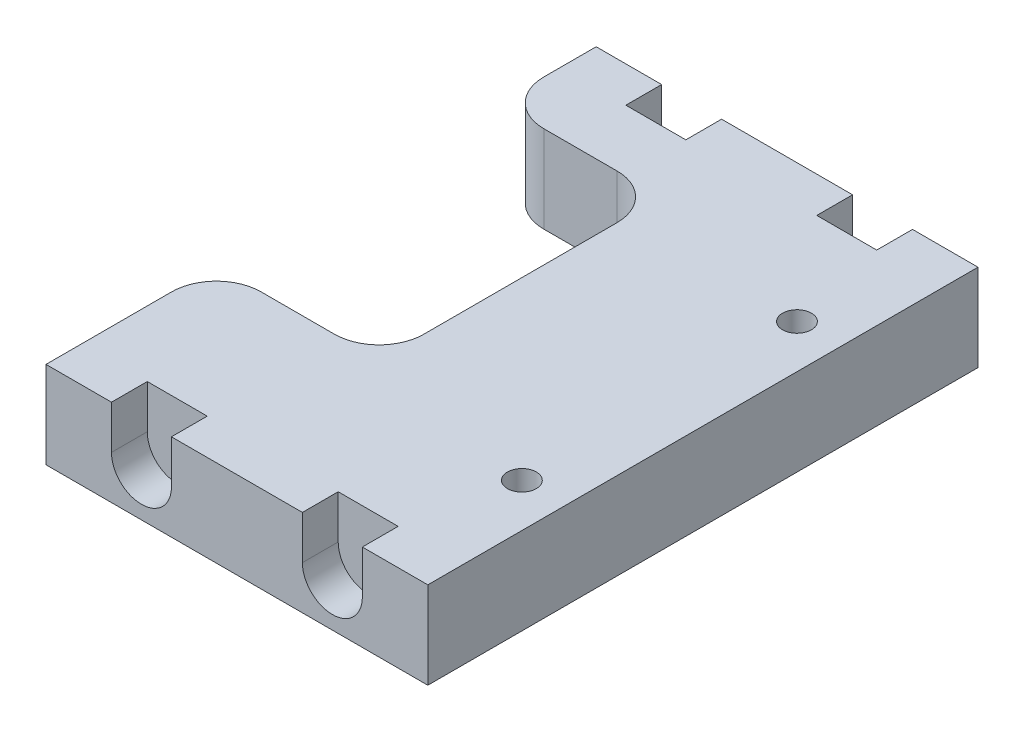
ISO-10303-21;
HEADER;
FILE_DESCRIPTION(('STEP AP214'),'2;1');
FILE_NAME('part.step','',(''),(''),'','','');
FILE_SCHEMA(('AUTOMOTIVE_DESIGN { 1 0 10303 214 1 1 1 1 }'));
ENDSEC;
DATA;
#1=APPLICATION_CONTEXT('core data for automotive mechanical design processes');
#2=APPLICATION_PROTOCOL_DEFINITION('international standard','automotive_design',2000,#1);
#3=PRODUCT_CONTEXT('',#1,'mechanical');
#4=PRODUCT('Part','Part','',(#3));
#5=PRODUCT_RELATED_PRODUCT_CATEGORY('part','',(#4));
#6=PRODUCT_DEFINITION_FORMATION('','',#4);
#7=PRODUCT_DEFINITION_CONTEXT('part definition',#1,'design');
#8=PRODUCT_DEFINITION('design','',#6,#7);
#9=PRODUCT_DEFINITION_SHAPE('','',#8);
#10=(LENGTH_UNIT() NAMED_UNIT(*) SI_UNIT(.MILLI.,.METRE.));
#11=(NAMED_UNIT(*) PLANE_ANGLE_UNIT() SI_UNIT($,.RADIAN.));
#12=(NAMED_UNIT(*) SI_UNIT($,.STERADIAN.) SOLID_ANGLE_UNIT());
#13=UNCERTAINTY_MEASURE_WITH_UNIT(LENGTH_MEASURE(1.E-05),#10,'distance_accuracy_value','');
#14=(GEOMETRIC_REPRESENTATION_CONTEXT(3) GLOBAL_UNCERTAINTY_ASSIGNED_CONTEXT((#13)) GLOBAL_UNIT_ASSIGNED_CONTEXT((#10,
#11,#12)) REPRESENTATION_CONTEXT('',''));
#15=CARTESIAN_POINT('',(0.,0.,0.));
#16=DIRECTION('',(0.,0.,1.));
#17=DIRECTION('',(1.,0.,0.));
#18=AXIS2_PLACEMENT_3D('',#15,#16,#17);
#19=CARTESIAN_POINT('',(-654.083526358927,561.091856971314,0.));
#20=DIRECTION('',(0.,1.,0.));
#21=DIRECTION('',(0.,0.,1.));
#22=AXIS2_PLACEMENT_3D('',#19,#20,#21);
#23=PLANE('',#22);
#24=CARTESIAN_POINT('',(-726.12842981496,561.091856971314,-19.5199000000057));
#25=DIRECTION('',(0.,1.,0.));
#26=DIRECTION('',(0.,0.,1.));
#27=AXIS2_PLACEMENT_3D('',#24,#25,#26);
#28=CIRCLE('',#27,2.05000000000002);
#29=CARTESIAN_POINT('',(-726.12842981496,561.091856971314,-17.4699000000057));
#30=VERTEX_POINT('',#29);
#31=EDGE_CURVE('E335',#30,#30,#28,.T.);
#32=ORIENTED_EDGE('',*,*,#31,.F.);
#33=EDGE_LOOP('',(#32));
#34=FACE_BOUND('',#33,.T.);
#35=CARTESIAN_POINT('',(-726.128429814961,561.091856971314,-58.5597000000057));
#36=DIRECTION('',(0.,1.,0.));
#37=DIRECTION('',(0.,0.,1.));
#38=AXIS2_PLACEMENT_3D('',#35,#36,#37);
#39=CIRCLE('',#38,2.05000000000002);
#40=CARTESIAN_POINT('',(-726.128429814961,561.091856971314,-56.5097000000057));
#41=VERTEX_POINT('',#40);
#42=EDGE_CURVE('E307',#41,#41,#39,.T.);
#43=ORIENTED_EDGE('',*,*,#42,.F.);
#44=EDGE_LOOP('',(#43));
#45=FACE_BOUND('',#44,.T.);
#46=DIRECTION('',(-1.,0.,0.));
#47=VECTOR('',#46,1.);
#48=CARTESIAN_POINT('',(-654.083526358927,561.091856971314,0.));
#49=LINE('',#48,#47);
#50=CARTESIAN_POINT('',(-764.852299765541,561.091856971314,0.));
#51=VERTEX_POINT('',#50);
#52=CARTESIAN_POINT('',(-774.144989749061,561.091856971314,0.));
#53=VERTEX_POINT('',#52);
#54=EDGE_CURVE('E435',#51,#53,#49,.T.);
#55=ORIENTED_EDGE('',*,*,#54,.F.);
#56=DIRECTION('',(0.,0.,1.));
#57=VECTOR('',#56,1.);
#58=CARTESIAN_POINT('',(-764.852299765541,561.091856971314,-5.08));
#59=LINE('',#58,#57);
#60=CARTESIAN_POINT('',(-764.852299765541,561.091856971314,-5.08));
#61=VERTEX_POINT('',#60);
#62=EDGE_CURVE('E318',#61,#51,#59,.T.);
#63=ORIENTED_EDGE('',*,*,#62,.F.);
#64=DIRECTION('',(-1.,0.,0.));
#65=VECTOR('',#64,1.);
#66=CARTESIAN_POINT('',(0.,561.091856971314,-5.08));
#67=LINE('',#66,#65);
#68=CARTESIAN_POINT('',(-756.343299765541,561.091856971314,-5.08));
#69=VERTEX_POINT('',#68);
#70=EDGE_CURVE('E292',#69,#61,#67,.T.);
#71=ORIENTED_EDGE('',*,*,#70,.F.);
#72=DIRECTION('',(0.,0.,1.));
#73=VECTOR('',#72,1.);
#74=CARTESIAN_POINT('',(-756.343299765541,561.091856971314,-5.08));
#75=LINE('',#74,#73);
#76=CARTESIAN_POINT('',(-756.343299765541,561.091856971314,0.));
#77=VERTEX_POINT('',#76);
#78=EDGE_CURVE('E287',#69,#77,#75,.T.);
#79=ORIENTED_EDGE('',*,*,#78,.T.);
#80=CARTESIAN_POINT('',(-737.757919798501,561.091856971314,0.));
#81=VERTEX_POINT('',#80);
#82=EDGE_CURVE('E444',#81,#77,#49,.T.);
#83=ORIENTED_EDGE('',*,*,#82,.F.);
#84=DIRECTION('',(0.,0.,1.));
#85=VECTOR('',#84,1.);
#86=CARTESIAN_POINT('',(-737.757919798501,561.091856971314,-5.08));
#87=LINE('',#86,#85);
#88=CARTESIAN_POINT('',(-737.757919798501,561.091856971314,-5.08));
#89=VERTEX_POINT('',#88);
#90=EDGE_CURVE('E341',#89,#81,#87,.T.);
#91=ORIENTED_EDGE('',*,*,#90,.F.);
#92=DIRECTION('',(-1.,0.,0.));
#93=VECTOR('',#92,1.);
#94=CARTESIAN_POINT('',(0.,561.091856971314,-5.08));
#95=LINE('',#94,#93);
#96=CARTESIAN_POINT('',(-729.248919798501,561.091856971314,-5.08));
#97=VERTEX_POINT('',#96);
#98=EDGE_CURVE('E327',#97,#89,#95,.T.);
#99=ORIENTED_EDGE('',*,*,#98,.F.);
#100=DIRECTION('',(0.,0.,1.));
#101=VECTOR('',#100,1.);
#102=CARTESIAN_POINT('',(-729.248919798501,561.091856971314,-5.08));
#103=LINE('',#102,#101);
#104=CARTESIAN_POINT('',(-729.248919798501,561.091856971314,0.));
#105=VERTEX_POINT('',#104);
#106=EDGE_CURVE('E343',#97,#105,#103,.T.);
#107=ORIENTED_EDGE('',*,*,#106,.T.);
#108=CARTESIAN_POINT('',(-719.95622981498,561.091856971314,2.22044604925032E-13));
#109=VERTEX_POINT('',#108);
#110=EDGE_CURVE('E440',#109,#105,#49,.T.);
#111=ORIENTED_EDGE('',*,*,#110,.F.);
#112=DIRECTION('',(0.,0.,-1.));
#113=VECTOR('',#112,1.);
#114=CARTESIAN_POINT('',(-719.95622981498,561.091856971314,2.22044604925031E-13));
#115=LINE('',#114,#113);
#116=CARTESIAN_POINT('',(-719.95622981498,561.091856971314,-78.0796));
#117=VERTEX_POINT('',#116);
#118=EDGE_CURVE('E371',#109,#117,#115,.T.);
#119=ORIENTED_EDGE('',*,*,#118,.T.);
#120=DIRECTION('',(1.,0.,0.));
#121=VECTOR('',#120,1.);
#122=CARTESIAN_POINT('',(-654.083526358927,561.091856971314,-78.0796));
#123=LINE('',#122,#121);
#124=CARTESIAN_POINT('',(-729.248919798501,561.091856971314,-78.0796));
#125=VERTEX_POINT('',#124);
#126=EDGE_CURVE('E443',#125,#117,#123,.T.);
#127=ORIENTED_EDGE('',*,*,#126,.F.);
#128=DIRECTION('',(0.,0.,-1.));
#129=VECTOR('',#128,1.);
#130=CARTESIAN_POINT('',(-729.248919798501,561.091856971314,-72.9996));
#131=LINE('',#130,#129);
#132=CARTESIAN_POINT('',(-729.248919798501,561.091856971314,-72.9996));
#133=VERTEX_POINT('',#132);
#134=EDGE_CURVE('E372',#133,#125,#131,.T.);
#135=ORIENTED_EDGE('',*,*,#134,.F.);
#136=DIRECTION('',(1.,0.,0.));
#137=VECTOR('',#136,1.);
#138=CARTESIAN_POINT('',(0.,561.091856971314,-72.9996));
#139=LINE('',#138,#137);
#140=CARTESIAN_POINT('',(-737.757919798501,561.091856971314,-72.9996));
#141=VERTEX_POINT('',#140);
#142=EDGE_CURVE('E353',#141,#133,#139,.T.);
#143=ORIENTED_EDGE('',*,*,#142,.F.);
#144=DIRECTION('',(0.,0.,-1.));
#145=VECTOR('',#144,1.);
#146=CARTESIAN_POINT('',(-737.757919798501,561.091856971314,-72.9996));
#147=LINE('',#146,#145);
#148=CARTESIAN_POINT('',(-737.757919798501,561.091856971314,-78.0796));
#149=VERTEX_POINT('',#148);
#150=EDGE_CURVE('E374',#141,#149,#147,.T.);
#151=ORIENTED_EDGE('',*,*,#150,.T.);
#152=CARTESIAN_POINT('',(-756.343299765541,561.091856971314,-78.0796));
#153=VERTEX_POINT('',#152);
#154=EDGE_CURVE('E449',#153,#149,#123,.T.);
#155=ORIENTED_EDGE('',*,*,#154,.F.);
#156=DIRECTION('',(0.,0.,-1.));
#157=VECTOR('',#156,1.);
#158=CARTESIAN_POINT('',(-756.343299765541,561.091856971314,-72.9996));
#159=LINE('',#158,#157);
#160=CARTESIAN_POINT('',(-756.343299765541,561.091856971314,-72.9996));
#161=VERTEX_POINT('',#160);
#162=EDGE_CURVE('E400',#161,#153,#159,.T.);
#163=ORIENTED_EDGE('',*,*,#162,.F.);
#164=DIRECTION('',(1.,0.,0.));
#165=VECTOR('',#164,1.);
#166=CARTESIAN_POINT('',(0.,561.091856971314,-72.9996));
#167=LINE('',#166,#165);
#168=CARTESIAN_POINT('',(-764.852299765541,561.091856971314,-72.9996));
#169=VERTEX_POINT('',#168);
#170=EDGE_CURVE('E385',#169,#161,#167,.T.);
#171=ORIENTED_EDGE('',*,*,#170,.F.);
#172=DIRECTION('',(0.,0.,-1.));
#173=VECTOR('',#172,1.);
#174=CARTESIAN_POINT('',(-764.852299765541,561.091856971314,-72.9996));
#175=LINE('',#174,#173);
#176=CARTESIAN_POINT('',(-764.852299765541,561.091856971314,-78.0796));
#177=VERTEX_POINT('',#176);
#178=EDGE_CURVE('E402',#169,#177,#175,.T.);
#179=ORIENTED_EDGE('',*,*,#178,.T.);
#180=CARTESIAN_POINT('',(-774.144989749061,561.091856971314,-78.0796));
#181=VERTEX_POINT('',#180);
#182=EDGE_CURVE('E445',#181,#177,#123,.T.);
#183=ORIENTED_EDGE('',*,*,#182,.F.);
#184=DIRECTION('',(0.,0.,1.));
#185=VECTOR('',#184,1.);
#186=CARTESIAN_POINT('',(-774.144989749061,561.091856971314,0.));
#187=LINE('',#186,#185);
#188=CARTESIAN_POINT('',(-774.144989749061,561.091856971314,-70.6412013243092));
#189=VERTEX_POINT('',#188);
#190=EDGE_CURVE('E450',#181,#189,#187,.T.);
#191=ORIENTED_EDGE('',*,*,#190,.T.);
#192=CARTESIAN_POINT('',(-767.794989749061,561.091856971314,-70.6412013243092));
#193=DIRECTION('',(0.,1.,0.));
#194=DIRECTION('',(0.,0.,1.));
#195=AXIS2_PLACEMENT_3D('',#192,#193,#194);
#196=CIRCLE('',#195,6.35);
#197=CARTESIAN_POINT('',(-767.794989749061,561.091856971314,-64.2912013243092));
#198=VERTEX_POINT('',#197);
#199=EDGE_CURVE('E480',#189,#198,#196,.T.);
#200=ORIENTED_EDGE('',*,*,#199,.T.);
#201=DIRECTION('',(1.,0.,0.));
#202=VECTOR('',#201,1.);
#203=CARTESIAN_POINT('',(0.,561.091856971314,-64.2912013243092));
#204=LINE('',#203,#202);
#205=CARTESIAN_POINT('',(-757.392582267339,561.091856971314,-64.2912013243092));
#206=VERTEX_POINT('',#205);
#207=EDGE_CURVE('E416',#198,#206,#204,.T.);
#208=ORIENTED_EDGE('',*,*,#207,.T.);
#209=CARTESIAN_POINT('',(-757.392582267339,561.091856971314,-57.9412013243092));
#210=DIRECTION('',(0.,1.,0.));
#211=DIRECTION('',(0.,0.,1.));
#212=AXIS2_PLACEMENT_3D('',#209,#210,#211);
#213=CIRCLE('',#212,6.35);
#214=CARTESIAN_POINT('',(-751.042582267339,561.091856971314,-57.9412013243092));
#215=VERTEX_POINT('',#214);
#216=EDGE_CURVE('E497',#206,#215,#213,.F.);
#217=ORIENTED_EDGE('',*,*,#216,.T.);
#218=DIRECTION('',(0.,0.,1.));
#219=VECTOR('',#218,1.);
#220=CARTESIAN_POINT('',(-751.042582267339,561.091856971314,0.));
#221=LINE('',#220,#219);
#222=CARTESIAN_POINT('',(-751.042582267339,561.091856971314,-30.5270013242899));
#223=VERTEX_POINT('',#222);
#224=EDGE_CURVE('E423',#215,#223,#221,.T.);
#225=ORIENTED_EDGE('',*,*,#224,.T.);
#226=CARTESIAN_POINT('',(-757.392582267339,561.091856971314,-30.5270013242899));
#227=DIRECTION('',(0.,1.,0.));
#228=DIRECTION('',(0.,0.,1.));
#229=AXIS2_PLACEMENT_3D('',#226,#227,#228);
#230=CIRCLE('',#229,6.35);
#231=CARTESIAN_POINT('',(-757.392582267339,561.091856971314,-24.1770013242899));
#232=VERTEX_POINT('',#231);
#233=EDGE_CURVE('E501',#223,#232,#230,.F.);
#234=ORIENTED_EDGE('',*,*,#233,.T.);
#235=DIRECTION('',(-1.,0.,0.));
#236=VECTOR('',#235,1.);
#237=CARTESIAN_POINT('',(0.,561.091856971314,-24.1770013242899));
#238=LINE('',#237,#236);
#239=CARTESIAN_POINT('',(-767.794989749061,561.091856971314,-24.1770013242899));
#240=VERTEX_POINT('',#239);
#241=EDGE_CURVE('E419',#232,#240,#238,.T.);
#242=ORIENTED_EDGE('',*,*,#241,.T.);
#243=CARTESIAN_POINT('',(-767.794989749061,561.091856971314,-17.8270013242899));
#244=DIRECTION('',(0.,1.,0.));
#245=DIRECTION('',(0.,0.,1.));
#246=AXIS2_PLACEMENT_3D('',#243,#244,#245);
#247=CIRCLE('',#246,6.35);
#248=CARTESIAN_POINT('',(-774.144989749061,561.091856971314,-17.8270013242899));
#249=VERTEX_POINT('',#248);
#250=EDGE_CURVE('E478',#240,#249,#247,.T.);
#251=ORIENTED_EDGE('',*,*,#250,.T.);
#252=EDGE_CURVE('E454',#249,#53,#187,.T.);
#253=ORIENTED_EDGE('',*,*,#252,.T.);
#254=EDGE_LOOP('',(#55,#63,#71,#79,#83,#91,#99,#107,#111,#119,#127,#135,#143,#151,#155,#163,
#171,#179,#183,#191,#200,#208,#217,#225,#234,#242,#251,#253));
#255=FACE_BOUND('',#254,.T.);
#256=ADVANCED_FACE('F93',(#34,#45,#255),#23,.T.);
#257=CARTESIAN_POINT('',(-1553.36997949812,0.,0.));
#258=DIRECTION('',(0.,0.,1.));
#259=DIRECTION('',(-1.,0.,0.));
#260=AXIS2_PLACEMENT_3D('',#257,#258,#259);
#261=PLANE('',#260);
#262=CARTESIAN_POINT('',(-760.597799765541,554.919656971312,0.));
#263=DIRECTION('',(0.,0.,1.));
#264=DIRECTION('',(1.,0.,0.));
#265=AXIS2_PLACEMENT_3D('',#262,#263,#264);
#266=CIRCLE('',#265,4.25450000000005);
#267=CARTESIAN_POINT('',(-756.343299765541,554.919656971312,0.));
#268=VERTEX_POINT('',#267);
#269=CARTESIAN_POINT('',(-764.852299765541,554.919656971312,0.));
#270=VERTEX_POINT('',#269);
#271=EDGE_CURVE('E109',#268,#270,#266,.F.);
#272=ORIENTED_EDGE('',*,*,#271,.T.);
#273=DIRECTION('',(0.,1.,0.));
#274=VECTOR('',#273,1.);
#275=CARTESIAN_POINT('',(-764.852299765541,0.,0.));
#276=LINE('',#275,#274);
#277=EDGE_CURVE('E301',#270,#51,#276,.T.);
#278=ORIENTED_EDGE('',*,*,#277,.T.);
#279=ORIENTED_EDGE('',*,*,#54,.T.);
#280=DIRECTION('',(0.,-1.,0.));
#281=VECTOR('',#280,1.);
#282=CARTESIAN_POINT('',(-774.144989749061,0.,0.));
#283=LINE('',#282,#281);
#284=CARTESIAN_POINT('',(-774.144989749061,548.747456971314,2.22044604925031E-13));
#285=VERTEX_POINT('',#284);
#286=EDGE_CURVE('E461',#53,#285,#283,.T.);
#287=ORIENTED_EDGE('',*,*,#286,.T.);
#288=DIRECTION('',(-1.,0.,0.));
#289=VECTOR('',#288,1.);
#290=CARTESIAN_POINT('',(105.83751986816,548.747456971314,2.22044604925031E-13));
#291=LINE('',#290,#289);
#292=CARTESIAN_POINT('',(-719.95622981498,548.747456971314,2.22044604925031E-13));
#293=VERTEX_POINT('',#292);
#294=EDGE_CURVE('E432',#293,#285,#291,.T.);
#295=ORIENTED_EDGE('',*,*,#294,.F.);
#296=DIRECTION('',(0.,-1.,0.));
#297=VECTOR('',#296,1.);
#298=CARTESIAN_POINT('',(-719.956229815,2.39355779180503E-11,2.22044604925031E-13));
#299=LINE('',#298,#297);
#300=EDGE_CURVE('E422',#109,#293,#299,.T.);
#301=ORIENTED_EDGE('',*,*,#300,.F.);
#302=ORIENTED_EDGE('',*,*,#110,.T.);
#303=DIRECTION('',(0.,-1.,0.));
#304=VECTOR('',#303,1.);
#305=CARTESIAN_POINT('',(-729.248919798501,0.,0.));
#306=LINE('',#305,#304);
#307=CARTESIAN_POINT('',(-729.248919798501,554.919656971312,0.));
#308=VERTEX_POINT('',#307);
#309=EDGE_CURVE('E334',#105,#308,#306,.T.);
#310=ORIENTED_EDGE('',*,*,#309,.T.);
#311=CARTESIAN_POINT('',(-733.503419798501,554.919656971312,0.));
#312=DIRECTION('',(0.,0.,1.));
#313=DIRECTION('',(1.,0.,0.));
#314=AXIS2_PLACEMENT_3D('',#311,#312,#313);
#315=CIRCLE('',#314,4.25450000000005);
#316=CARTESIAN_POINT('',(-737.757919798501,554.919656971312,0.));
#317=VERTEX_POINT('',#316);
#318=EDGE_CURVE('E117',#308,#317,#315,.F.);
#319=ORIENTED_EDGE('',*,*,#318,.T.);
#320=DIRECTION('',(0.,1.,0.));
#321=VECTOR('',#320,1.);
#322=CARTESIAN_POINT('',(-737.757919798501,0.,0.));
#323=LINE('',#322,#321);
#324=EDGE_CURVE('E325',#317,#81,#323,.T.);
#325=ORIENTED_EDGE('',*,*,#324,.T.);
#326=ORIENTED_EDGE('',*,*,#82,.T.);
#327=DIRECTION('',(0.,-1.,0.));
#328=VECTOR('',#327,1.);
#329=CARTESIAN_POINT('',(-756.343299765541,0.,0.));
#330=LINE('',#329,#328);
#331=EDGE_CURVE('E304',#77,#268,#330,.T.);
#332=ORIENTED_EDGE('',*,*,#331,.T.);
#333=EDGE_LOOP('',(#272,#278,#279,#287,#295,#301,#302,#310,#319,#325,#326,#332));
#334=FACE_BOUND('',#333,.T.);
#335=ADVANCED_FACE('F565',(#334),#261,.T.);
#336=CARTESIAN_POINT('',(-1553.36997949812,0.,-78.0796));
#337=DIRECTION('',(0.,0.,-1.));
#338=DIRECTION('',(1.,0.,0.));
#339=AXIS2_PLACEMENT_3D('',#336,#337,#338);
#340=PLANE('',#339);
#341=CARTESIAN_POINT('',(-733.503419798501,554.919656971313,-78.0796));
#342=DIRECTION('',(0.,0.,-1.));
#343=DIRECTION('',(-1.,0.,0.));
#344=AXIS2_PLACEMENT_3D('',#341,#342,#343);
#345=CIRCLE('',#344,4.25450000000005);
#346=CARTESIAN_POINT('',(-737.757919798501,554.919656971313,-78.0796));
#347=VERTEX_POINT('',#346);
#348=CARTESIAN_POINT('',(-729.248919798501,554.919656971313,-78.0796));
#349=VERTEX_POINT('',#348);
#350=EDGE_CURVE('E359',#347,#349,#345,.F.);
#351=ORIENTED_EDGE('',*,*,#350,.T.);
#352=DIRECTION('',(0.,1.,0.));
#353=VECTOR('',#352,1.);
#354=CARTESIAN_POINT('',(-729.248919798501,0.,-78.0796));
#355=LINE('',#354,#353);
#356=EDGE_CURVE('E351',#349,#125,#355,.T.);
#357=ORIENTED_EDGE('',*,*,#356,.T.);
#358=ORIENTED_EDGE('',*,*,#126,.T.);
#359=DIRECTION('',(0.,1.,0.));
#360=VECTOR('',#359,1.);
#361=CARTESIAN_POINT('',(-719.956229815,2.51751805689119E-11,-78.0796));
#362=LINE('',#361,#360);
#363=CARTESIAN_POINT('',(-719.95622981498,548.747456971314,-78.0796));
#364=VERTEX_POINT('',#363);
#365=EDGE_CURVE('E428',#364,#117,#362,.T.);
#366=ORIENTED_EDGE('',*,*,#365,.F.);
#367=DIRECTION('',(1.,0.,0.));
#368=VECTOR('',#367,1.);
#369=CARTESIAN_POINT('',(0.,548.747456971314,-78.0796));
#370=LINE('',#369,#368);
#371=CARTESIAN_POINT('',(-774.144989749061,548.747456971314,-78.0796));
#372=VERTEX_POINT('',#371);
#373=EDGE_CURVE('E431',#372,#364,#370,.T.);
#374=ORIENTED_EDGE('',*,*,#373,.F.);
#375=DIRECTION('',(0.,-1.,0.));
#376=VECTOR('',#375,1.);
#377=CARTESIAN_POINT('',(-774.144989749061,562.158656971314,-78.0796));
#378=LINE('',#377,#376);
#379=EDGE_CURVE('E453',#181,#372,#378,.T.);
#380=ORIENTED_EDGE('',*,*,#379,.F.);
#381=ORIENTED_EDGE('',*,*,#182,.T.);
#382=DIRECTION('',(0.,-1.,0.));
#383=VECTOR('',#382,1.);
#384=CARTESIAN_POINT('',(-764.852299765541,0.,-78.0796));
#385=LINE('',#384,#383);
#386=CARTESIAN_POINT('',(-764.852299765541,554.919656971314,-78.0796));
#387=VERTEX_POINT('',#386);
#388=EDGE_CURVE('E393',#177,#387,#385,.T.);
#389=ORIENTED_EDGE('',*,*,#388,.T.);
#390=CARTESIAN_POINT('',(-760.597799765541,554.919656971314,-78.0796));
#391=DIRECTION('',(0.,0.,-1.));
#392=DIRECTION('',(-1.,0.,0.));
#393=AXIS2_PLACEMENT_3D('',#390,#391,#392);
#394=CIRCLE('',#393,4.25450000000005);
#395=CARTESIAN_POINT('',(-756.343299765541,554.919656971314,-78.0796));
#396=VERTEX_POINT('',#395);
#397=EDGE_CURVE('E317',#387,#396,#394,.F.);
#398=ORIENTED_EDGE('',*,*,#397,.T.);
#399=DIRECTION('',(0.,1.,0.));
#400=VECTOR('',#399,1.);
#401=CARTESIAN_POINT('',(-756.343299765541,0.,-78.0796));
#402=LINE('',#401,#400);
#403=EDGE_CURVE('E383',#396,#153,#402,.T.);
#404=ORIENTED_EDGE('',*,*,#403,.T.);
#405=ORIENTED_EDGE('',*,*,#154,.T.);
#406=DIRECTION('',(0.,-1.,0.));
#407=VECTOR('',#406,1.);
#408=CARTESIAN_POINT('',(-737.757919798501,0.,-78.0796));
#409=LINE('',#408,#407);
#410=EDGE_CURVE('E362',#149,#347,#409,.T.);
#411=ORIENTED_EDGE('',*,*,#410,.T.);
#412=EDGE_LOOP('',(#351,#357,#358,#366,#374,#380,#381,#389,#398,#404,#405,#411));
#413=FACE_BOUND('',#412,.T.);
#414=ADVANCED_FACE('F523',(#413),#340,.T.);
#415=CARTESIAN_POINT('',(-1553.36997949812,548.747456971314,0.));
#416=DIRECTION('',(0.,-1.,0.));
#417=DIRECTION('',(0.,0.,-1.));
#418=AXIS2_PLACEMENT_3D('',#415,#416,#417);
#419=PLANE('',#418);
#420=CARTESIAN_POINT('',(-726.12842981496,548.747456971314,-19.5199000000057));
#421=DIRECTION('',(0.,-1.,0.));
#422=DIRECTION('',(0.,0.,-1.));
#423=AXIS2_PLACEMENT_3D('',#420,#421,#422);
#424=CIRCLE('',#423,3.31999999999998);
#425=CARTESIAN_POINT('',(-726.12842981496,548.747456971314,-22.8399000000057));
#426=VERTEX_POINT('',#425);
#427=EDGE_CURVE('E506',#426,#426,#424,.F.);
#428=ORIENTED_EDGE('',*,*,#427,.T.);
#429=EDGE_LOOP('',(#428));
#430=FACE_BOUND('',#429,.T.);
#431=CARTESIAN_POINT('',(-726.128429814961,548.747456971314,-58.5597000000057));
#432=DIRECTION('',(0.,-1.,0.));
#433=DIRECTION('',(0.,0.,-1.));
#434=AXIS2_PLACEMENT_3D('',#431,#432,#433);
#435=CIRCLE('',#434,3.32);
#436=CARTESIAN_POINT('',(-726.128429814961,548.747456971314,-61.8797000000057));
#437=VERTEX_POINT('',#436);
#438=EDGE_CURVE('E503',#437,#437,#435,.F.);
#439=ORIENTED_EDGE('',*,*,#438,.T.);
#440=EDGE_LOOP('',(#439));
#441=FACE_BOUND('',#440,.T.);
#442=DIRECTION('',(1.,0.,0.));
#443=VECTOR('',#442,1.);
#444=CARTESIAN_POINT('',(0.,548.747456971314,-64.2912013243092));
#445=LINE('',#444,#443);
#446=CARTESIAN_POINT('',(-767.794989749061,548.747456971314,-64.2912013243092));
#447=VERTEX_POINT('',#446);
#448=CARTESIAN_POINT('',(-757.392582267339,548.747456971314,-64.2912013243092));
#449=VERTEX_POINT('',#448);
#450=EDGE_CURVE('E409',#447,#449,#445,.T.);
#451=ORIENTED_EDGE('',*,*,#450,.F.);
#452=CARTESIAN_POINT('',(-767.794989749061,548.747456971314,-70.6412013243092));
#453=DIRECTION('',(0.,-1.,0.));
#454=DIRECTION('',(0.,0.,-1.));
#455=AXIS2_PLACEMENT_3D('',#452,#453,#454);
#456=CIRCLE('',#455,6.35);
#457=CARTESIAN_POINT('',(-774.144989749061,548.747456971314,-70.6412013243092));
#458=VERTEX_POINT('',#457);
#459=EDGE_CURVE('E474',#447,#458,#456,.T.);
#460=ORIENTED_EDGE('',*,*,#459,.T.);
#461=DIRECTION('',(0.,0.,1.));
#462=VECTOR('',#461,1.);
#463=CARTESIAN_POINT('',(-774.144989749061,548.747456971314,-84.4296));
#464=LINE('',#463,#462);
#465=EDGE_CURVE('E455',#372,#458,#464,.T.);
#466=ORIENTED_EDGE('',*,*,#465,.F.);
#467=ORIENTED_EDGE('',*,*,#373,.T.);
#468=DIRECTION('',(0.,0.,1.));
#469=VECTOR('',#468,1.);
#470=CARTESIAN_POINT('',(-719.95622981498,548.747456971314,-84.4296));
#471=LINE('',#470,#469);
#472=EDGE_CURVE('E458',#364,#293,#471,.T.);
#473=ORIENTED_EDGE('',*,*,#472,.T.);
#474=ORIENTED_EDGE('',*,*,#294,.T.);
#475=CARTESIAN_POINT('',(-774.144989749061,548.747456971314,-17.8270013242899));
#476=VERTEX_POINT('',#475);
#477=EDGE_CURVE('E448',#476,#285,#464,.T.);
#478=ORIENTED_EDGE('',*,*,#477,.F.);
#479=CARTESIAN_POINT('',(-767.794989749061,548.747456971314,-17.8270013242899));
#480=DIRECTION('',(0.,-1.,0.));
#481=DIRECTION('',(0.,0.,-1.));
#482=AXIS2_PLACEMENT_3D('',#479,#480,#481);
#483=CIRCLE('',#482,6.35);
#484=CARTESIAN_POINT('',(-767.794989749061,548.747456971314,-24.1770013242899));
#485=VERTEX_POINT('',#484);
#486=EDGE_CURVE('E472',#476,#485,#483,.T.);
#487=ORIENTED_EDGE('',*,*,#486,.T.);
#488=DIRECTION('',(-1.,0.,0.));
#489=VECTOR('',#488,1.);
#490=CARTESIAN_POINT('',(0.,548.747456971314,-24.1770013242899));
#491=LINE('',#490,#489);
#492=CARTESIAN_POINT('',(-757.392582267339,548.747456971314,-24.1770013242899));
#493=VERTEX_POINT('',#492);
#494=EDGE_CURVE('E413',#493,#485,#491,.T.);
#495=ORIENTED_EDGE('',*,*,#494,.F.);
#496=CARTESIAN_POINT('',(-757.392582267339,548.747456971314,-30.5270013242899));
#497=DIRECTION('',(0.,-1.,0.));
#498=DIRECTION('',(0.,0.,-1.));
#499=AXIS2_PLACEMENT_3D('',#496,#497,#498);
#500=CIRCLE('',#499,6.35);
#501=CARTESIAN_POINT('',(-751.042582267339,548.747456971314,-30.5270013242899));
#502=VERTEX_POINT('',#501);
#503=EDGE_CURVE('E499',#493,#502,#500,.F.);
#504=ORIENTED_EDGE('',*,*,#503,.T.);
#505=DIRECTION('',(0.,0.,1.));
#506=VECTOR('',#505,1.);
#507=CARTESIAN_POINT('',(-751.042582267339,548.747456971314,0.));
#508=LINE('',#507,#506);
#509=CARTESIAN_POINT('',(-751.042582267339,548.747456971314,-57.9412013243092));
#510=VERTEX_POINT('',#509);
#511=EDGE_CURVE('E410',#510,#502,#508,.T.);
#512=ORIENTED_EDGE('',*,*,#511,.F.);
#513=CARTESIAN_POINT('',(-757.392582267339,548.747456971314,-57.9412013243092));
#514=DIRECTION('',(0.,-1.,0.));
#515=DIRECTION('',(0.,0.,-1.));
#516=AXIS2_PLACEMENT_3D('',#513,#514,#515);
#517=CIRCLE('',#516,6.35);
#518=EDGE_CURVE('E495',#510,#449,#517,.F.);
#519=ORIENTED_EDGE('',*,*,#518,.T.);
#520=EDGE_LOOP('',(#451,#460,#466,#467,#473,#474,#478,#487,#495,#504,#512,#519));
#521=FACE_BOUND('',#520,.T.);
#522=ADVANCED_FACE('F519',(#430,#441,#521),#419,.T.);
#523=CARTESIAN_POINT('',(-719.95622981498,0.,0.));
#524=DIRECTION('',(1.,0.,0.));
#525=DIRECTION('',(0.,0.,1.));
#526=AXIS2_PLACEMENT_3D('',#523,#524,#525);
#527=PLANE('',#526);
#528=ORIENTED_EDGE('',*,*,#472,.F.);
#529=ORIENTED_EDGE('',*,*,#365,.T.);
#530=ORIENTED_EDGE('',*,*,#118,.F.);
#531=ORIENTED_EDGE('',*,*,#300,.T.);
#532=EDGE_LOOP('',(#528,#529,#530,#531));
#533=FACE_BOUND('',#532,.T.);
#534=ADVANCED_FACE('F522',(#533),#527,.T.);
#535=CARTESIAN_POINT('',(-774.144989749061,0.,6.35));
#536=DIRECTION('',(-1.,0.,0.));
#537=DIRECTION('',(0.,0.,-1.));
#538=AXIS2_PLACEMENT_3D('',#535,#536,#537);
#539=PLANE('',#538);
#540=ORIENTED_EDGE('',*,*,#465,.T.);
#541=DIRECTION('',(0.,-1.,0.));
#542=VECTOR('',#541,1.);
#543=CARTESIAN_POINT('',(-774.144989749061,561.091856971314,-70.6412013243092));
#544=LINE('',#543,#542);
#545=EDGE_CURVE('E476',#458,#189,#544,.F.);
#546=ORIENTED_EDGE('',*,*,#545,.T.);
#547=ORIENTED_EDGE('',*,*,#190,.F.);
#548=ORIENTED_EDGE('',*,*,#379,.T.);
#549=EDGE_LOOP('',(#540,#546,#547,#548));
#550=FACE_BOUND('',#549,.T.);
#551=ADVANCED_FACE('F648',(#550),#539,.T.);
#552=ORIENTED_EDGE('',*,*,#252,.F.);
#553=DIRECTION('',(0.,-1.,0.));
#554=VECTOR('',#553,1.);
#555=CARTESIAN_POINT('',(-774.144989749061,548.747456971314,-17.8270013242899));
#556=LINE('',#555,#554);
#557=EDGE_CURVE('E492',#249,#476,#556,.T.);
#558=ORIENTED_EDGE('',*,*,#557,.T.);
#559=ORIENTED_EDGE('',*,*,#477,.T.);
#560=ORIENTED_EDGE('',*,*,#286,.F.);
#561=EDGE_LOOP('',(#552,#558,#559,#560));
#562=FACE_BOUND('',#561,.T.);
#563=ADVANCED_FACE('F562',(#562),#539,.T.);
#564=CARTESIAN_POINT('',(0.,631.232088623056,-64.2912013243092));
#565=DIRECTION('',(0.,0.,-1.));
#566=DIRECTION('',(-1.,0.,0.));
#567=AXIS2_PLACEMENT_3D('',#564,#565,#566);
#568=PLANE('',#567);
#569=ORIENTED_EDGE('',*,*,#207,.F.);
#570=DIRECTION('',(0.,-1.,0.));
#571=VECTOR('',#570,1.);
#572=CARTESIAN_POINT('',(-767.794989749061,548.747456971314,-64.2912013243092));
#573=LINE('',#572,#571);
#574=EDGE_CURVE('E469',#198,#447,#573,.T.);
#575=ORIENTED_EDGE('',*,*,#574,.T.);
#576=ORIENTED_EDGE('',*,*,#450,.T.);
#577=DIRECTION('',(0.,-1.,0.));
#578=VECTOR('',#577,1.);
#579=CARTESIAN_POINT('',(-757.392582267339,561.091856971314,-64.2912013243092));
#580=LINE('',#579,#578);
#581=EDGE_CURVE('E464',#449,#206,#580,.F.);
#582=ORIENTED_EDGE('',*,*,#581,.T.);
#583=EDGE_LOOP('',(#569,#575,#576,#582));
#584=FACE_BOUND('',#583,.T.);
#585=ADVANCED_FACE('F533',(#584),#568,.F.);
#586=CARTESIAN_POINT('',(-751.042582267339,631.232088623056,0.));
#587=DIRECTION('',(1.,0.,0.));
#588=DIRECTION('',(0.,0.,-1.));
#589=AXIS2_PLACEMENT_3D('',#586,#587,#588);
#590=PLANE('',#589);
#591=ORIENTED_EDGE('',*,*,#224,.F.);
#592=DIRECTION('',(0.,-1.,0.));
#593=VECTOR('',#592,1.);
#594=CARTESIAN_POINT('',(-751.042582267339,548.747456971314,-57.9412013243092));
#595=LINE('',#594,#593);
#596=EDGE_CURVE('E484',#215,#510,#595,.T.);
#597=ORIENTED_EDGE('',*,*,#596,.T.);
#598=ORIENTED_EDGE('',*,*,#511,.T.);
#599=DIRECTION('',(0.,-1.,0.));
#600=VECTOR('',#599,1.);
#601=CARTESIAN_POINT('',(-751.042582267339,561.091856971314,-30.5270013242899));
#602=LINE('',#601,#600);
#603=EDGE_CURVE('E482',#502,#223,#602,.F.);
#604=ORIENTED_EDGE('',*,*,#603,.T.);
#605=EDGE_LOOP('',(#591,#597,#598,#604));
#606=FACE_BOUND('',#605,.T.);
#607=ADVANCED_FACE('F544',(#606),#590,.F.);
#608=CARTESIAN_POINT('',(0.,631.232088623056,-24.1770013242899));
#609=DIRECTION('',(0.,0.,1.));
#610=DIRECTION('',(1.,0.,0.));
#611=AXIS2_PLACEMENT_3D('',#608,#609,#610);
#612=PLANE('',#611);
#613=ORIENTED_EDGE('',*,*,#241,.F.);
#614=DIRECTION('',(0.,-1.,0.));
#615=VECTOR('',#614,1.);
#616=CARTESIAN_POINT('',(-757.392582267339,548.747456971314,-24.1770013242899));
#617=LINE('',#616,#615);
#618=EDGE_CURVE('E489',#232,#493,#617,.T.);
#619=ORIENTED_EDGE('',*,*,#618,.T.);
#620=ORIENTED_EDGE('',*,*,#494,.T.);
#621=DIRECTION('',(0.,-1.,0.));
#622=VECTOR('',#621,1.);
#623=CARTESIAN_POINT('',(-767.794989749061,561.091856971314,-24.1770013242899));
#624=LINE('',#623,#622);
#625=EDGE_CURVE('E487',#485,#240,#624,.F.);
#626=ORIENTED_EDGE('',*,*,#625,.T.);
#627=EDGE_LOOP('',(#613,#619,#620,#626));
#628=FACE_BOUND('',#627,.T.);
#629=ADVANCED_FACE('F552',(#628),#612,.F.);
#630=CARTESIAN_POINT('',(-767.794989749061,631.232088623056,-70.6412013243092));
#631=DIRECTION('',(0.,1.,0.));
#632=DIRECTION('',(0.,0.,1.));
#633=AXIS2_PLACEMENT_3D('',#630,#631,#632);
#634=CYLINDRICAL_SURFACE('',#633,6.35);
#635=ORIENTED_EDGE('',*,*,#199,.F.);
#636=ORIENTED_EDGE('',*,*,#545,.F.);
#637=ORIENTED_EDGE('',*,*,#459,.F.);
#638=ORIENTED_EDGE('',*,*,#574,.F.);
#639=EDGE_LOOP('',(#635,#636,#637,#638));
#640=FACE_BOUND('',#639,.T.);
#641=ADVANCED_FACE('F609',(#640),#634,.T.);
#642=CARTESIAN_POINT('',(-757.392582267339,631.232088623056,-57.9412013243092));
#643=DIRECTION('',(0.,1.,0.));
#644=DIRECTION('',(0.,0.,1.));
#645=AXIS2_PLACEMENT_3D('',#642,#643,#644);
#646=CYLINDRICAL_SURFACE('',#645,6.35);
#647=ORIENTED_EDGE('',*,*,#216,.F.);
#648=ORIENTED_EDGE('',*,*,#581,.F.);
#649=ORIENTED_EDGE('',*,*,#518,.F.);
#650=ORIENTED_EDGE('',*,*,#596,.F.);
#651=EDGE_LOOP('',(#647,#648,#649,#650));
#652=FACE_BOUND('',#651,.T.);
#653=ADVANCED_FACE('F537',(#652),#646,.F.);
#654=CARTESIAN_POINT('',(-757.392582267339,631.232088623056,-30.5270013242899));
#655=DIRECTION('',(0.,1.,0.));
#656=DIRECTION('',(0.,0.,1.));
#657=AXIS2_PLACEMENT_3D('',#654,#655,#656);
#658=CYLINDRICAL_SURFACE('',#657,6.35);
#659=ORIENTED_EDGE('',*,*,#233,.F.);
#660=ORIENTED_EDGE('',*,*,#603,.F.);
#661=ORIENTED_EDGE('',*,*,#503,.F.);
#662=ORIENTED_EDGE('',*,*,#618,.F.);
#663=EDGE_LOOP('',(#659,#660,#661,#662));
#664=FACE_BOUND('',#663,.T.);
#665=ADVANCED_FACE('F547',(#664),#658,.F.);
#666=CARTESIAN_POINT('',(-767.794989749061,0.,-17.8270013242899));
#667=DIRECTION('',(0.,1.,0.));
#668=DIRECTION('',(0.,0.,1.));
#669=AXIS2_PLACEMENT_3D('',#666,#667,#668);
#670=CYLINDRICAL_SURFACE('',#669,6.35);
#671=ORIENTED_EDGE('',*,*,#250,.F.);
#672=ORIENTED_EDGE('',*,*,#625,.F.);
#673=ORIENTED_EDGE('',*,*,#486,.F.);
#674=ORIENTED_EDGE('',*,*,#557,.F.);
#675=EDGE_LOOP('',(#671,#672,#673,#674));
#676=FACE_BOUND('',#675,.T.);
#677=ADVANCED_FACE('F556',(#676),#670,.T.);
#678=CARTESIAN_POINT('',(-760.597799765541,554.919656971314,-72.9996));
#679=DIRECTION('',(0.,0.,-1.));
#680=DIRECTION('',(-1.,0.,0.));
#681=AXIS2_PLACEMENT_3D('',#678,#679,#680);
#682=CYLINDRICAL_SURFACE('',#681,4.25450000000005);
#683=ORIENTED_EDGE('',*,*,#397,.F.);
#684=DIRECTION('',(0.,0.,-1.));
#685=VECTOR('',#684,1.);
#686=CARTESIAN_POINT('',(-764.852299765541,554.919656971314,-72.9996));
#687=LINE('',#686,#685);
#688=CARTESIAN_POINT('',(-764.852299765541,554.919656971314,-72.9996));
#689=VERTEX_POINT('',#688);
#690=EDGE_CURVE('E390',#689,#387,#687,.T.);
#691=ORIENTED_EDGE('',*,*,#690,.F.);
#692=CARTESIAN_POINT('',(-760.597799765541,554.919656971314,-72.9996));
#693=DIRECTION('',(0.,0.,-1.));
#694=DIRECTION('',(-1.,0.,0.));
#695=AXIS2_PLACEMENT_3D('',#692,#693,#694);
#696=CIRCLE('',#695,4.25450000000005);
#697=CARTESIAN_POINT('',(-756.343299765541,554.919656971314,-72.9996));
#698=VERTEX_POINT('',#697);
#699=EDGE_CURVE('E379',#689,#698,#696,.F.);
#700=ORIENTED_EDGE('',*,*,#699,.T.);
#701=DIRECTION('',(0.,0.,-1.));
#702=VECTOR('',#701,1.);
#703=CARTESIAN_POINT('',(-756.343299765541,554.919656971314,-72.9996));
#704=LINE('',#703,#702);
#705=EDGE_CURVE('E363',#698,#396,#704,.T.);
#706=ORIENTED_EDGE('',*,*,#705,.T.);
#707=EDGE_LOOP('',(#683,#691,#700,#706));
#708=FACE_BOUND('',#707,.T.);
#709=ADVANCED_FACE('F618',(#708),#682,.F.);
#710=CARTESIAN_POINT('',(-756.343299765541,0.,-72.9996));
#711=DIRECTION('',(-1.,0.,0.));
#712=DIRECTION('',(0.,0.,1.));
#713=AXIS2_PLACEMENT_3D('',#710,#711,#712);
#714=PLANE('',#713);
#715=ORIENTED_EDGE('',*,*,#403,.F.);
#716=ORIENTED_EDGE('',*,*,#705,.F.);
#717=DIRECTION('',(0.,1.,0.));
#718=VECTOR('',#717,1.);
#719=CARTESIAN_POINT('',(-756.343299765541,0.,-72.9996));
#720=LINE('',#719,#718);
#721=EDGE_CURVE('E388',#698,#161,#720,.T.);
#722=ORIENTED_EDGE('',*,*,#721,.T.);
#723=ORIENTED_EDGE('',*,*,#162,.T.);
#724=EDGE_LOOP('',(#715,#716,#722,#723));
#725=FACE_BOUND('',#724,.T.);
#726=ADVANCED_FACE('F628',(#725),#714,.T.);
#727=CARTESIAN_POINT('',(-764.852299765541,0.,-72.9996));
#728=DIRECTION('',(1.,0.,0.));
#729=DIRECTION('',(0.,0.,-1.));
#730=AXIS2_PLACEMENT_3D('',#727,#728,#729);
#731=PLANE('',#730);
#732=ORIENTED_EDGE('',*,*,#388,.F.);
#733=ORIENTED_EDGE('',*,*,#178,.F.);
#734=DIRECTION('',(0.,-1.,0.));
#735=VECTOR('',#734,1.);
#736=CARTESIAN_POINT('',(-764.852299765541,0.,-72.9996));
#737=LINE('',#736,#735);
#738=EDGE_CURVE('E382',#169,#689,#737,.T.);
#739=ORIENTED_EDGE('',*,*,#738,.T.);
#740=ORIENTED_EDGE('',*,*,#690,.T.);
#741=EDGE_LOOP('',(#732,#733,#739,#740));
#742=FACE_BOUND('',#741,.T.);
#743=ADVANCED_FACE('F635',(#742),#731,.T.);
#744=CARTESIAN_POINT('',(0.,0.,-72.9996));
#745=DIRECTION('',(0.,0.,-1.));
#746=DIRECTION('',(-1.,0.,0.));
#747=AXIS2_PLACEMENT_3D('',#744,#745,#746);
#748=PLANE('',#747);
#749=ORIENTED_EDGE('',*,*,#699,.F.);
#750=ORIENTED_EDGE('',*,*,#738,.F.);
#751=ORIENTED_EDGE('',*,*,#170,.T.);
#752=ORIENTED_EDGE('',*,*,#721,.F.);
#753=EDGE_LOOP('',(#749,#750,#751,#752));
#754=FACE_BOUND('',#753,.T.);
#755=ADVANCED_FACE('F676',(#754),#748,.T.);
#756=CARTESIAN_POINT('',(-733.503419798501,554.919656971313,-72.9996));
#757=DIRECTION('',(0.,0.,-1.));
#758=DIRECTION('',(-1.,0.,0.));
#759=AXIS2_PLACEMENT_3D('',#756,#757,#758);
#760=CYLINDRICAL_SURFACE('',#759,4.25450000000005);
#761=ORIENTED_EDGE('',*,*,#350,.F.);
#762=DIRECTION('',(0.,0.,-1.));
#763=VECTOR('',#762,1.);
#764=CARTESIAN_POINT('',(-737.757919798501,554.919656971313,-72.9996));
#765=LINE('',#764,#763);
#766=CARTESIAN_POINT('',(-737.757919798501,554.919656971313,-72.9996));
#767=VERTEX_POINT('',#766);
#768=EDGE_CURVE('E358',#767,#347,#765,.T.);
#769=ORIENTED_EDGE('',*,*,#768,.F.);
#770=CARTESIAN_POINT('',(-733.503419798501,554.919656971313,-72.9996));
#771=DIRECTION('',(0.,0.,-1.));
#772=DIRECTION('',(-1.,0.,0.));
#773=AXIS2_PLACEMENT_3D('',#770,#771,#772);
#774=CIRCLE('',#773,4.25450000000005);
#775=CARTESIAN_POINT('',(-729.248919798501,554.919656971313,-72.9996));
#776=VERTEX_POINT('',#775);
#777=EDGE_CURVE('E347',#767,#776,#774,.F.);
#778=ORIENTED_EDGE('',*,*,#777,.T.);
#779=DIRECTION('',(0.,0.,-1.));
#780=VECTOR('',#779,1.);
#781=CARTESIAN_POINT('',(-729.248919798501,554.919656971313,-72.9996));
#782=LINE('',#781,#780);
#783=EDGE_CURVE('E368',#776,#349,#782,.T.);
#784=ORIENTED_EDGE('',*,*,#783,.T.);
#785=EDGE_LOOP('',(#761,#769,#778,#784));
#786=FACE_BOUND('',#785,.T.);
#787=ADVANCED_FACE('F656',(#786),#760,.F.);
#788=CARTESIAN_POINT('',(-729.248919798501,0.,-72.9996));
#789=DIRECTION('',(-1.,0.,0.));
#790=DIRECTION('',(0.,0.,1.));
#791=AXIS2_PLACEMENT_3D('',#788,#789,#790);
#792=PLANE('',#791);
#793=ORIENTED_EDGE('',*,*,#356,.F.);
#794=ORIENTED_EDGE('',*,*,#783,.F.);
#795=DIRECTION('',(0.,1.,0.));
#796=VECTOR('',#795,1.);
#797=CARTESIAN_POINT('',(-729.248919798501,0.,-72.9996));
#798=LINE('',#797,#796);
#799=EDGE_CURVE('E356',#776,#133,#798,.T.);
#800=ORIENTED_EDGE('',*,*,#799,.T.);
#801=ORIENTED_EDGE('',*,*,#134,.T.);
#802=EDGE_LOOP('',(#793,#794,#800,#801));
#803=FACE_BOUND('',#802,.T.);
#804=ADVANCED_FACE('F668',(#803),#792,.T.);
#805=CARTESIAN_POINT('',(-737.757919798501,0.,-72.9996));
#806=DIRECTION('',(1.,0.,0.));
#807=DIRECTION('',(0.,0.,-1.));
#808=AXIS2_PLACEMENT_3D('',#805,#806,#807);
#809=PLANE('',#808);
#810=ORIENTED_EDGE('',*,*,#410,.F.);
#811=ORIENTED_EDGE('',*,*,#150,.F.);
#812=DIRECTION('',(0.,-1.,0.));
#813=VECTOR('',#812,1.);
#814=CARTESIAN_POINT('',(-737.757919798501,0.,-72.9996));
#815=LINE('',#814,#813);
#816=EDGE_CURVE('E350',#141,#767,#815,.T.);
#817=ORIENTED_EDGE('',*,*,#816,.T.);
#818=ORIENTED_EDGE('',*,*,#768,.T.);
#819=EDGE_LOOP('',(#810,#811,#817,#818));
#820=FACE_BOUND('',#819,.T.);
#821=ADVANCED_FACE('F660',(#820),#809,.T.);
#822=CARTESIAN_POINT('',(0.,0.,-72.9996));
#823=DIRECTION('',(0.,0.,-1.));
#824=DIRECTION('',(-1.,0.,0.));
#825=AXIS2_PLACEMENT_3D('',#822,#823,#824);
#826=PLANE('',#825);
#827=ORIENTED_EDGE('',*,*,#777,.F.);
#828=ORIENTED_EDGE('',*,*,#816,.F.);
#829=ORIENTED_EDGE('',*,*,#142,.T.);
#830=ORIENTED_EDGE('',*,*,#799,.F.);
#831=EDGE_LOOP('',(#827,#828,#829,#830));
#832=FACE_BOUND('',#831,.T.);
#833=ADVANCED_FACE('F664',(#832),#826,.T.);
#834=CARTESIAN_POINT('',(-733.503419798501,554.919656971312,-5.08));
#835=DIRECTION('',(0.,0.,1.));
#836=DIRECTION('',(1.,0.,0.));
#837=AXIS2_PLACEMENT_3D('',#834,#835,#836);
#838=CYLINDRICAL_SURFACE('',#837,4.25450000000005);
#839=ORIENTED_EDGE('',*,*,#318,.F.);
#840=DIRECTION('',(0.,0.,1.));
#841=VECTOR('',#840,1.);
#842=CARTESIAN_POINT('',(-729.248919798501,554.919656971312,-5.08));
#843=LINE('',#842,#841);
#844=CARTESIAN_POINT('',(-729.248919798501,554.919656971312,-5.08));
#845=VERTEX_POINT('',#844);
#846=EDGE_CURVE('E332',#845,#308,#843,.T.);
#847=ORIENTED_EDGE('',*,*,#846,.F.);
#848=CARTESIAN_POINT('',(-733.503419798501,554.919656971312,-5.08));
#849=DIRECTION('',(0.,0.,1.));
#850=DIRECTION('',(1.,0.,0.));
#851=AXIS2_PLACEMENT_3D('',#848,#849,#850);
#852=CIRCLE('',#851,4.25450000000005);
#853=CARTESIAN_POINT('',(-737.757919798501,554.919656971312,-5.08));
#854=VERTEX_POINT('',#853);
#855=EDGE_CURVE('E321',#845,#854,#852,.F.);
#856=ORIENTED_EDGE('',*,*,#855,.T.);
#857=DIRECTION('',(0.,0.,1.));
#858=VECTOR('',#857,1.);
#859=CARTESIAN_POINT('',(-737.757919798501,554.919656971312,-5.08));
#860=LINE('',#859,#858);
#861=EDGE_CURVE('E313',#854,#317,#860,.T.);
#862=ORIENTED_EDGE('',*,*,#861,.T.);
#863=EDGE_LOOP('',(#839,#847,#856,#862));
#864=FACE_BOUND('',#863,.T.);
#865=ADVANCED_FACE('F581',(#864),#838,.F.);
#866=CARTESIAN_POINT('',(-737.757919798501,0.,-5.08));
#867=DIRECTION('',(1.,0.,0.));
#868=DIRECTION('',(0.,0.,-1.));
#869=AXIS2_PLACEMENT_3D('',#866,#867,#868);
#870=PLANE('',#869);
#871=ORIENTED_EDGE('',*,*,#324,.F.);
#872=ORIENTED_EDGE('',*,*,#861,.F.);
#873=DIRECTION('',(0.,1.,0.));
#874=VECTOR('',#873,1.);
#875=CARTESIAN_POINT('',(-737.757919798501,0.,-5.08));
#876=LINE('',#875,#874);
#877=EDGE_CURVE('E330',#854,#89,#876,.T.);
#878=ORIENTED_EDGE('',*,*,#877,.T.);
#879=ORIENTED_EDGE('',*,*,#90,.T.);
#880=EDGE_LOOP('',(#871,#872,#878,#879));
#881=FACE_BOUND('',#880,.T.);
#882=ADVANCED_FACE('F583',(#881),#870,.T.);
#883=CARTESIAN_POINT('',(-729.248919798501,0.,-5.08));
#884=DIRECTION('',(-1.,0.,0.));
#885=DIRECTION('',(0.,0.,1.));
#886=AXIS2_PLACEMENT_3D('',#883,#884,#885);
#887=PLANE('',#886);
#888=ORIENTED_EDGE('',*,*,#309,.F.);
#889=ORIENTED_EDGE('',*,*,#106,.F.);
#890=DIRECTION('',(0.,-1.,0.));
#891=VECTOR('',#890,1.);
#892=CARTESIAN_POINT('',(-729.248919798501,0.,-5.08));
#893=LINE('',#892,#891);
#894=EDGE_CURVE('E324',#97,#845,#893,.T.);
#895=ORIENTED_EDGE('',*,*,#894,.T.);
#896=ORIENTED_EDGE('',*,*,#846,.T.);
#897=EDGE_LOOP('',(#888,#889,#895,#896));
#898=FACE_BOUND('',#897,.T.);
#899=ADVANCED_FACE('F576',(#898),#887,.T.);
#900=CARTESIAN_POINT('',(0.,0.,-5.08));
#901=DIRECTION('',(0.,0.,1.));
#902=DIRECTION('',(1.,0.,0.));
#903=AXIS2_PLACEMENT_3D('',#900,#901,#902);
#904=PLANE('',#903);
#905=ORIENTED_EDGE('',*,*,#855,.F.);
#906=ORIENTED_EDGE('',*,*,#894,.F.);
#907=ORIENTED_EDGE('',*,*,#98,.T.);
#908=ORIENTED_EDGE('',*,*,#877,.F.);
#909=EDGE_LOOP('',(#905,#906,#907,#908));
#910=FACE_BOUND('',#909,.T.);
#911=ADVANCED_FACE('F579',(#910),#904,.T.);
#912=CARTESIAN_POINT('',(-760.597799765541,554.919656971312,-5.08));
#913=DIRECTION('',(0.,0.,1.));
#914=DIRECTION('',(1.,0.,0.));
#915=AXIS2_PLACEMENT_3D('',#912,#913,#914);
#916=CYLINDRICAL_SURFACE('',#915,4.25450000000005);
#917=ORIENTED_EDGE('',*,*,#271,.F.);
#918=DIRECTION('',(0.,0.,1.));
#919=VECTOR('',#918,1.);
#920=CARTESIAN_POINT('',(-756.343299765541,554.919656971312,-5.08));
#921=LINE('',#920,#919);
#922=CARTESIAN_POINT('',(-756.343299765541,554.919656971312,-5.08));
#923=VERTEX_POINT('',#922);
#924=EDGE_CURVE('E284',#923,#268,#921,.T.);
#925=ORIENTED_EDGE('',*,*,#924,.F.);
#926=CARTESIAN_POINT('',(-760.597799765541,554.919656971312,-5.08));
#927=DIRECTION('',(0.,0.,1.));
#928=DIRECTION('',(1.,0.,0.));
#929=AXIS2_PLACEMENT_3D('',#926,#927,#928);
#930=CIRCLE('',#929,4.25450000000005);
#931=CARTESIAN_POINT('',(-764.852299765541,554.919656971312,-5.08));
#932=VERTEX_POINT('',#931);
#933=EDGE_CURVE('E293',#923,#932,#930,.F.);
#934=ORIENTED_EDGE('',*,*,#933,.T.);
#935=DIRECTION('',(0.,0.,1.));
#936=VECTOR('',#935,1.);
#937=CARTESIAN_POINT('',(-764.852299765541,554.919656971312,-5.08));
#938=LINE('',#937,#936);
#939=EDGE_CURVE('E315',#932,#270,#938,.T.);
#940=ORIENTED_EDGE('',*,*,#939,.T.);
#941=EDGE_LOOP('',(#917,#925,#934,#940));
#942=FACE_BOUND('',#941,.T.);
#943=ADVANCED_FACE('F296',(#942),#916,.F.);
#944=CARTESIAN_POINT('',(-764.852299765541,0.,-5.08));
#945=DIRECTION('',(1.,0.,0.));
#946=DIRECTION('',(0.,0.,-1.));
#947=AXIS2_PLACEMENT_3D('',#944,#945,#946);
#948=PLANE('',#947);
#949=ORIENTED_EDGE('',*,*,#277,.F.);
#950=ORIENTED_EDGE('',*,*,#939,.F.);
#951=DIRECTION('',(0.,1.,0.));
#952=VECTOR('',#951,1.);
#953=CARTESIAN_POINT('',(-764.852299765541,0.,-5.08));
#954=LINE('',#953,#952);
#955=EDGE_CURVE('E298',#932,#61,#954,.T.);
#956=ORIENTED_EDGE('',*,*,#955,.T.);
#957=ORIENTED_EDGE('',*,*,#62,.T.);
#958=EDGE_LOOP('',(#949,#950,#956,#957));
#959=FACE_BOUND('',#958,.T.);
#960=ADVANCED_FACE('F588',(#959),#948,.T.);
#961=CARTESIAN_POINT('',(-756.343299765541,0.,-5.08));
#962=DIRECTION('',(-1.,0.,0.));
#963=DIRECTION('',(0.,0.,1.));
#964=AXIS2_PLACEMENT_3D('',#961,#962,#963);
#965=PLANE('',#964);
#966=ORIENTED_EDGE('',*,*,#331,.F.);
#967=ORIENTED_EDGE('',*,*,#78,.F.);
#968=DIRECTION('',(0.,-1.,0.));
#969=VECTOR('',#968,1.);
#970=CARTESIAN_POINT('',(-756.343299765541,0.,-5.08));
#971=LINE('',#970,#969);
#972=EDGE_CURVE('E282',#69,#923,#971,.T.);
#973=ORIENTED_EDGE('',*,*,#972,.T.);
#974=ORIENTED_EDGE('',*,*,#924,.T.);
#975=EDGE_LOOP('',(#966,#967,#973,#974));
#976=FACE_BOUND('',#975,.T.);
#977=ADVANCED_FACE('F283',(#976),#965,.T.);
#978=CARTESIAN_POINT('',(0.,0.,-5.08));
#979=DIRECTION('',(0.,0.,1.));
#980=DIRECTION('',(1.,0.,0.));
#981=AXIS2_PLACEMENT_3D('',#978,#979,#980);
#982=PLANE('',#981);
#983=ORIENTED_EDGE('',*,*,#933,.F.);
#984=ORIENTED_EDGE('',*,*,#972,.F.);
#985=ORIENTED_EDGE('',*,*,#70,.T.);
#986=ORIENTED_EDGE('',*,*,#955,.F.);
#987=EDGE_LOOP('',(#983,#984,#985,#986));
#988=FACE_BOUND('',#987,.T.);
#989=ADVANCED_FACE('F300',(#988),#982,.T.);
#990=CARTESIAN_POINT('',(-726.128429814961,548.747456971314,-58.5597000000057));
#991=DIRECTION('',(0.,1.,0.));
#992=DIRECTION('',(0.,0.,1.));
#993=AXIS2_PLACEMENT_3D('',#990,#991,#992);
#994=CYLINDRICAL_SURFACE('',#993,2.05000000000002);
#995=CARTESIAN_POINT('',(-726.128429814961,550.017456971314,-58.5597000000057));
#996=DIRECTION('',(0.,-1.,0.));
#997=DIRECTION('',(0.,0.,-1.));
#998=AXIS2_PLACEMENT_3D('',#995,#996,#997);
#999=CIRCLE('',#998,2.05000000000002);
#1000=CARTESIAN_POINT('',(-726.128429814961,550.017456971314,-60.6097000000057));
#1001=VERTEX_POINT('',#1000);
#1002=EDGE_CURVE('E12',#1001,#1001,#999,.T.);
#1003=ORIENTED_EDGE('',*,*,#1002,.T.);
#1004=EDGE_LOOP('',(#1003));
#1005=FACE_BOUND('',#1004,.T.);
#1006=ORIENTED_EDGE('',*,*,#42,.T.);
#1007=EDGE_LOOP('',(#1006));
#1008=FACE_BOUND('',#1007,.T.);
#1009=ADVANCED_FACE('F1033',(#1005,#1008),#994,.F.);
#1010=CARTESIAN_POINT('',(-726.12842981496,548.747456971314,-19.5199000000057));
#1011=DIRECTION('',(0.,1.,0.));
#1012=DIRECTION('',(0.,0.,1.));
#1013=AXIS2_PLACEMENT_3D('',#1010,#1011,#1012);
#1014=CYLINDRICAL_SURFACE('',#1013,2.05000000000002);
#1015=CARTESIAN_POINT('',(-726.12842981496,550.017456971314,-19.5199000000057));
#1016=DIRECTION('',(0.,-1.,0.));
#1017=DIRECTION('',(0.,0.,-1.));
#1018=AXIS2_PLACEMENT_3D('',#1015,#1016,#1017);
#1019=CIRCLE('',#1018,2.05000000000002);
#1020=CARTESIAN_POINT('',(-726.12842981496,550.017456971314,-21.5699000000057));
#1021=VERTEX_POINT('',#1020);
#1022=EDGE_CURVE('E102',#1021,#1021,#1019,.T.);
#1023=ORIENTED_EDGE('',*,*,#1022,.T.);
#1024=EDGE_LOOP('',(#1023));
#1025=FACE_BOUND('',#1024,.T.);
#1026=ORIENTED_EDGE('',*,*,#31,.T.);
#1027=EDGE_LOOP('',(#1026));
#1028=FACE_BOUND('',#1027,.T.);
#1029=ADVANCED_FACE('F511',(#1025,#1028),#1014,.F.);
#1030=CARTESIAN_POINT('',(-726.12842981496,548.747456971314,-19.5199000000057));
#1031=DIRECTION('',(0.,-1.,0.));
#1032=DIRECTION('',(0.,0.,-1.));
#1033=AXIS2_PLACEMENT_3D('',#1030,#1031,#1032);
#1034=CONICAL_SURFACE('',#1033,3.31999999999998,0.785398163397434);
#1035=ORIENTED_EDGE('',*,*,#1022,.F.);
#1036=EDGE_LOOP('',(#1035));
#1037=FACE_BOUND('',#1036,.T.);
#1038=ORIENTED_EDGE('',*,*,#427,.F.);
#1039=EDGE_LOOP('',(#1038));
#1040=FACE_BOUND('',#1039,.T.);
#1041=ADVANCED_FACE('F514',(#1037,#1040),#1034,.F.);
#1042=CARTESIAN_POINT('',(-726.128429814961,548.747456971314,-58.5597000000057));
#1043=DIRECTION('',(0.,-1.,0.));
#1044=DIRECTION('',(0.,0.,-1.));
#1045=AXIS2_PLACEMENT_3D('',#1042,#1043,#1044);
#1046=CONICAL_SURFACE('',#1045,3.32,0.785398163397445);
#1047=ORIENTED_EDGE('',*,*,#1002,.F.);
#1048=EDGE_LOOP('',(#1047));
#1049=FACE_BOUND('',#1048,.T.);
#1050=ORIENTED_EDGE('',*,*,#438,.F.);
#1051=EDGE_LOOP('',(#1050));
#1052=FACE_BOUND('',#1051,.T.);
#1053=ADVANCED_FACE('F96',(#1049,#1052),#1046,.F.);
#1054=CLOSED_SHELL('',(#256,#335,#414,#522,#534,#551,#563,#585,#607,#629,#641,#653,#665,#677,
#709,#726,#743,#755,#787,#804,#821,#833,#865,#882,#899,#911,#943,#960,#977,#989,#1009,#1029,
#1041,#1053));
#1055=MANIFOLD_SOLID_BREP('B2',#1054);
#1056=ADVANCED_BREP_SHAPE_REPRESENTATION('',(#18,#1055),#14);
#1057=SHAPE_DEFINITION_REPRESENTATION(#9,#1056);
ENDSEC;
END-ISO-10303-21;
